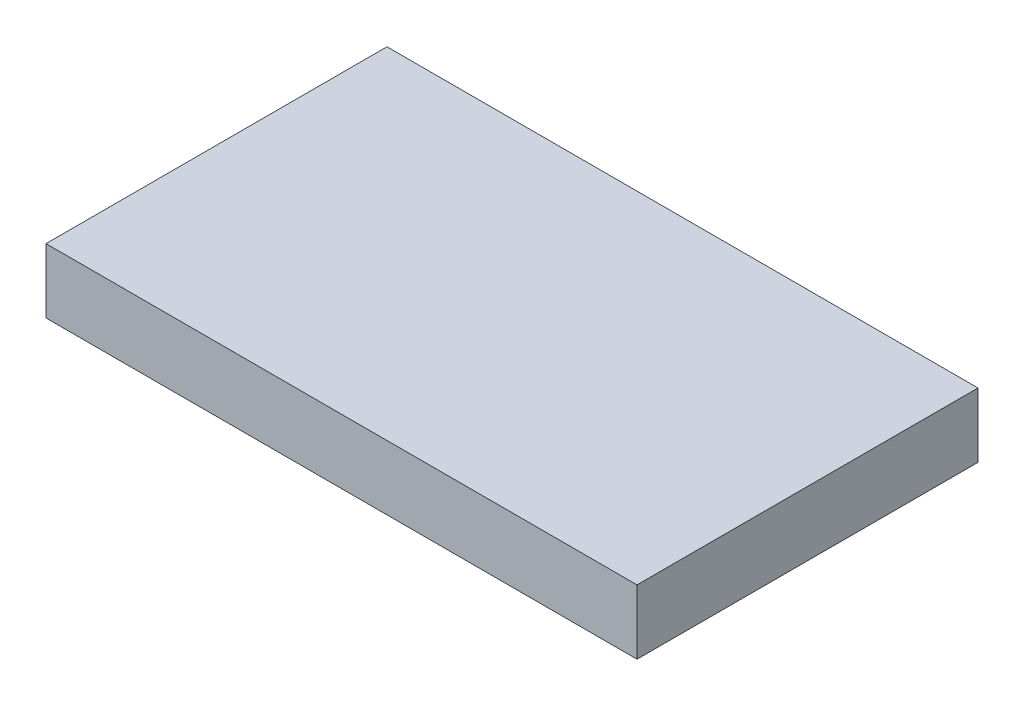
from build123d import *

# Parameters (mm, degrees)
ESBO_O1_W       = 156
ESBO_O1_H       = 90
EXTRUS_O1_DEPTH = 17


with BuildPart() as part:
    # Esbo_o1 → Extrus_o1 (new body)
    with BuildSketch(Plane(origin=(0, 0, 0), x_dir=(1, 0, 0), z_dir=(0, 1, 0))):
        Rectangle(ESBO_O1_W, ESBO_O1_H)
    extrude(amount=EXTRUS_O1_DEPTH)


solid = part.part
